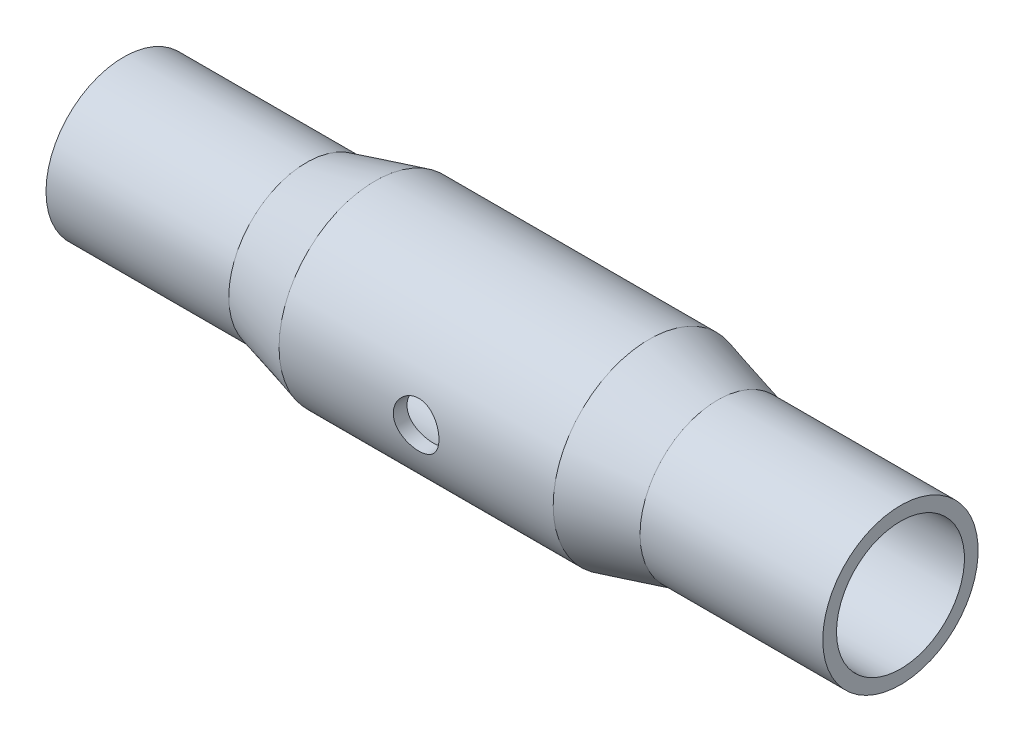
from build123d import *

# Parameters (mm, degrees)
ESQUISSE2_R             = 5
ENL_V_MAT_EXTRU_1_DEPTH = 30


with BuildPart() as part:
    # Esquisse1 → R_vol.-Mince1 (revolve)
    with BuildSketch(Plane.XY, mode=Mode.PRIVATE) as r_vol_mince1_sk:
        Polygon((-67.008472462, 17), (-27.008472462, 17), (-12.008472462, 21), (47.991527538, 21), (62.991527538, 17), (102.991527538, 17), (102.991527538, 14), (62.598396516, 14), (47.598396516, 18), (-11.61534144, 18), (-26.61534144, 14), (-67.008472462, 14), align=None)
    revolve(r_vol_mince1_sk.sketch.rotate(Axis((-91.895693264, 0, 0), (1, 0, 0)), 90), axis=Axis((-91.895693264, 0, 0), (1, 0, 0)))

    # Esquisse2 → Enl_v. mat.-Extru.1 (cut, symmetric)
    with BuildSketch(Plane.XY):
        with Locations((17.991527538, 0)):
            Circle(ESQUISSE2_R)
    extrude(amount=ENL_V_MAT_EXTRU_1_DEPTH, both=True, mode=Mode.SUBTRACT)


solid = part.part
